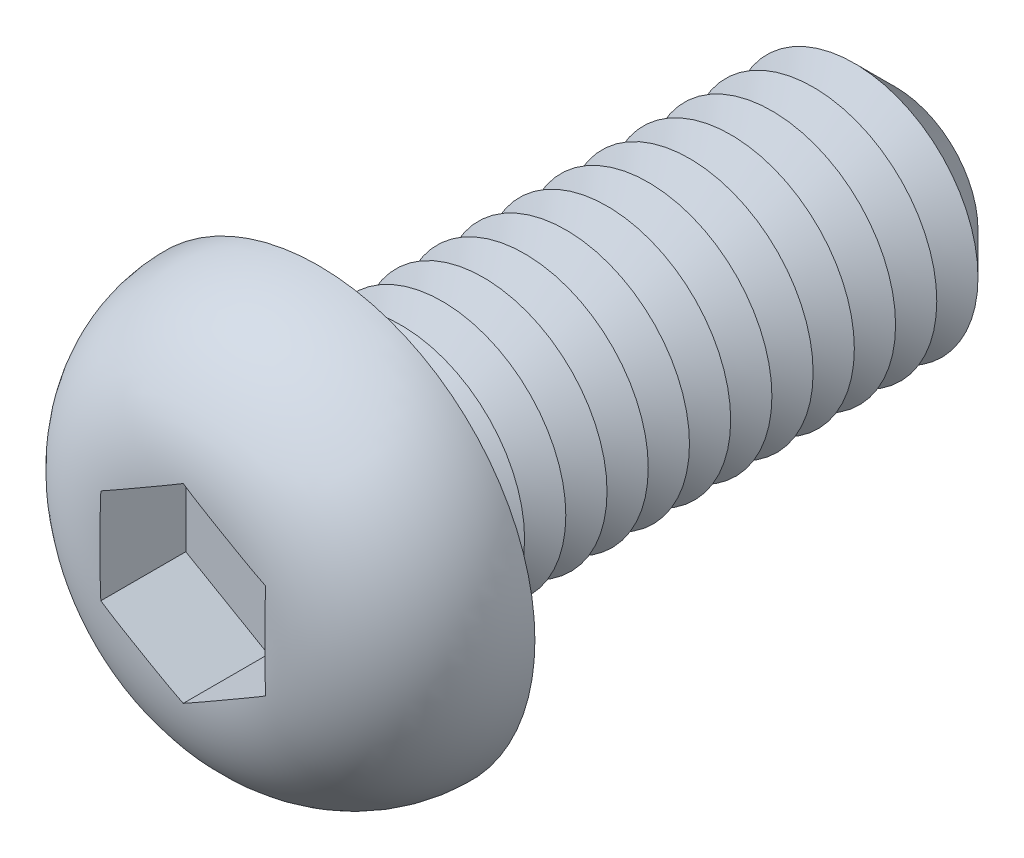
from build123d import *

# Parameters (mm, degrees)
CUT_EXTRUDE1_DEPTH  = 2.08
SKETCH4_R           = 3
BOSS_EXTRUDE1_DEPTH = 14
CHAMFER1_SIZE       = 1
LPATTERN1_COUNT     = 12
LPATTERN1_PITCH     = 1
FILLET2_R           = 0.5
SKETCH6_R           = 0.8
CUT_EXTRUDE2_DEPTH  = 15.22


with BuildPart() as part:
    # Sketch2 → Revolve1 (revolve)
    with BuildSketch(Plane(origin=(0, 0, 0), x_dir=(0, 0, -1), z_dir=(1, 0, 0)), mode=Mode.PRIVATE) as revolve1_sk:
        with BuildLine():
            Line((0, 0), (-3.3, 0))
            Line((-3.3, 0), (-3.3, 1.95))
            ThreePointArc((-3.3, 1.95), (-2.333452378, 4.283452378), (0, 5.25))
            Line((0, 5.25), (0, 0))
        make_face()
    revolve(revolve1_sk.sketch.rotate(Axis((0, 0, 47.934239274), (0, 0, -1)), 90), axis=Axis((0, 0, 47.934239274), (0, 0, -1)))

    # Sketch3 → Cut-Extrude1 (cut)
    with BuildSketch(Plane.XY.offset(3.3)):
        Polygon((0, 2.309401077), (-2, 1.154700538), (-2, -1.154700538), (0, -2.309401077), (2, -1.154700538), (2, 1.154700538), align=None)
    extrude(amount=-CUT_EXTRUDE1_DEPTH, mode=Mode.SUBTRACT)

    # Sketch4 → Boss-Extrude1 (add)
    with BuildSketch(Plane(origin=(0, 0, 0), x_dir=(-1, 0, 0), z_dir=(0, 0, -1))):
        with Locations(Location((0, 0, 0), (0, 0, 180))):
            Circle(SKETCH4_R)
    extrude(amount=BOSS_EXTRUDE1_DEPTH)

    # Chamfer1
    chamfer1_edges = [part.edges().sort_by_distance(p)[0] for p in [
        (-3, 0, -14),
    ]]
    chamfer(chamfer1_edges, length=CHAMFER1_SIZE)

    # Sketch5 → Cut-Revolve1 (revolve, cut)
    with BuildSketch(Plane(origin=(0, 0, 0), x_dir=(0, 0, -1), z_dir=(1, 0, 0)), mode=Mode.PRIVATE) as cut_revolve1_sk:
        Polygon((1, 3), (2, 3), (1.5, 2.133974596), align=None)
    cut_revolve1 = revolve(cut_revolve1_sk.sketch.rotate(Axis((0, 0, 47.934239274), (0, 0, -1)), 90), axis=Axis((0, 0, 47.934239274), (0, 0, -1)), mode=Mode.SUBTRACT)

    # LPattern1: Cut-Revolve1 ×12
    with Locations(*[(0, 0, -i * LPATTERN1_PITCH) for i in range(1, LPATTERN1_COUNT)]):
        add(cut_revolve1, mode=Mode.SUBTRACT)

    # Fillet2
    fillet2_edges = [part.edges().sort_by_distance(p)[0] for p in [
        (-3, 0, 0),
    ]]
    fillet(fillet2_edges, radius=FILLET2_R)

    # Sketch6 → Cut-Extrude2 (cut)
    with BuildSketch(Plane.XY.offset(1.22)):
        Circle(SKETCH6_R)
    extrude(amount=-CUT_EXTRUDE2_DEPTH, mode=Mode.SUBTRACT)


solid = part.part
